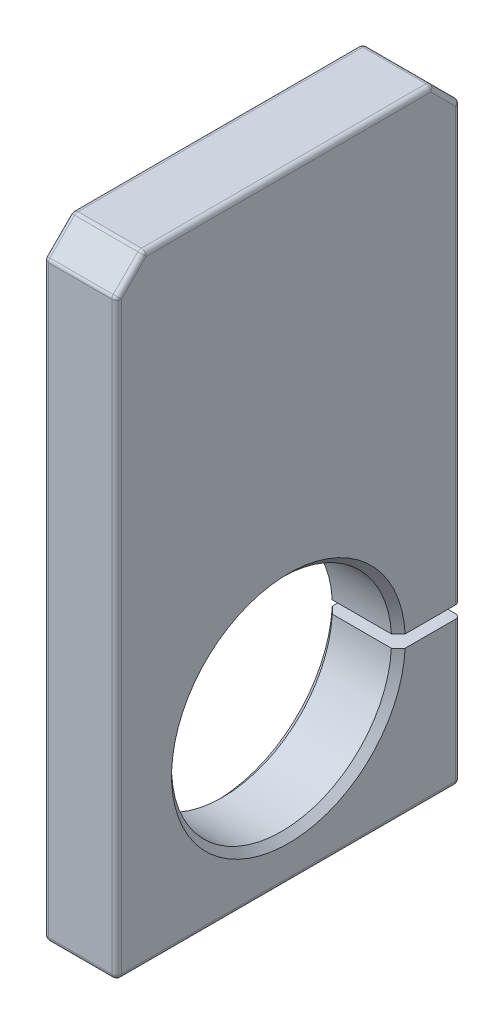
from build123d import *

# Parameters (mm, degrees)
BASE_EXTRUSION_DEPTH    = 2.65
CHANFREIN1_SIZE         = 2
CHANFREIN2_SIZE         = 0.5
CONG_1_R                = 0.35
ENL_V_START             = -10.55
ESQUISSE2_R             = 1.25
ENL_V_MAT_EXTRU_1_DEPTH = 10.55
ESQUISSE3_R             = 0.875
ENL_V_MAT_EXTRU_2_DEPTH = 7


with BuildPart() as part:
    # Esquisse1 → Base-Extrusion (new, symmetric)
    with BuildSketch(Plane(origin=(0, 0, 0), x_dir=(0, 0, -1), z_dir=(1, 0, 0))):
        with BuildLine():
            Line((7.987333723, 0.45), (12.5, 0.45))
            Line((12.5, 0.45), (12.5, 34))
            Line((12.5, 34), (-12.5, 34))
            Line((-12.5, 34), (-12.5, -11))
            Line((-12.5, -11), (12.5, -11))
            Line((12.5, -11), (12.5, -0.45))
            Line((12.5, -0.45), (7.987333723, -0.45))
            ThreePointArc((7.987333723, -0.45), (-8, 0), (7.987333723, 0.45))
        make_face()
    extrude(amount=BASE_EXTRUSION_DEPTH, both=True)

    # Chanfrein1
    chanfrein1_edges = [part.edges().sort_by_distance(p)[0] for p in [
        (0, 34, 12.5),
        (0, 34, -12.5),
    ]]
    chamfer(chanfrein1_edges, length=CHANFREIN1_SIZE)

    # Chanfrein2
    chanfrein2_edges = [part.edges().sort_by_distance(p)[0] for p in [
        (-2.65, 0, 8),
        (2.65, 0, 8),
    ]]
    chamfer(chanfrein2_edges, length=CHANFREIN2_SIZE)

    # Cong_1
    cong_1_edges = [part.edges().sort_by_distance(p)[0] for p in [
        (-2.65, -5.725, -12.5),
        (2.65, -11, 0),
        (0, -11, -12.5),
        (0, -11, 12.5),
        (-2.65, 16.225, -12.5),
        (2.65, 34, 0),
        (-2.65, 34, 0),
        (0, 34, -10.5),
        (0, 34, 10.5),
        (2.65, 10.5, 12.5),
        (2.65, 33, -11.5),
        (2.65, 33, 11.5),
        (-2.65, 10.5, 12.5),
        (0, 32, 12.5),
        (-2.65, 33, -11.5),
        (-2.65, 33, 11.5),
        (0, 32, -12.5),
        (-2.65, -11, 0),
        (2.65, 16.225, -12.5),
        (2.65, -5.725, -12.5),
    ]]
    fillet(cong_1_edges, radius=CONG_1_R)

    # Esquisse2 → Enl_v. mat.-Extru.1 (cut)
    with BuildSketch(Plane.XZ.offset(11).offset(ENL_V_START)):
        with Locations(Location((0, -10.243666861, 0), (0, 0, 270))):
            Circle(ESQUISSE2_R)
    extrude(amount=ENL_V_MAT_EXTRU_1_DEPTH, mode=Mode.SUBTRACT)

    # Esquisse3 → Enl_v. mat.-Extru.2 (cut)
    with BuildSketch(Plane.XZ.offset(-0.45)):
        with Locations(Location((0, -10.243666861, 0), (0, 0, 270))):
            Circle(ESQUISSE3_R)
    extrude(amount=-ENL_V_MAT_EXTRU_2_DEPTH, mode=Mode.SUBTRACT)


solid = part.part
